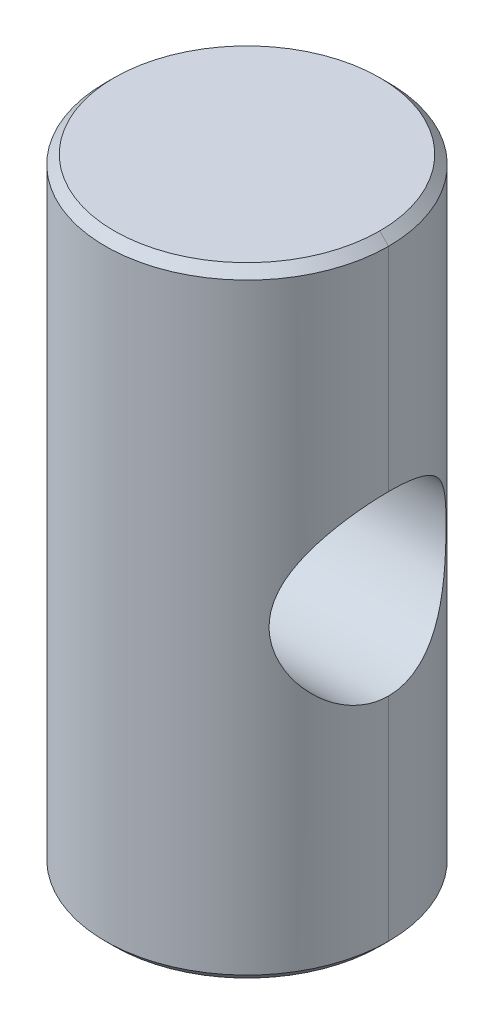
ISO-10303-21;
HEADER;
FILE_DESCRIPTION(('STEP AP214'),'2;1');
FILE_NAME('part.step','',(''),(''),'','','');
FILE_SCHEMA(('AUTOMOTIVE_DESIGN { 1 0 10303 214 1 1 1 1 }'));
ENDSEC;
DATA;
#1=APPLICATION_CONTEXT('core data for automotive mechanical design processes');
#2=APPLICATION_PROTOCOL_DEFINITION('international standard','automotive_design',2000,#1);
#3=PRODUCT_CONTEXT('',#1,'mechanical');
#4=PRODUCT('Part','Part','',(#3));
#5=PRODUCT_RELATED_PRODUCT_CATEGORY('part','',(#4));
#6=PRODUCT_DEFINITION_FORMATION('','',#4);
#7=PRODUCT_DEFINITION_CONTEXT('part definition',#1,'design');
#8=PRODUCT_DEFINITION('design','',#6,#7);
#9=PRODUCT_DEFINITION_SHAPE('','',#8);
#10=(LENGTH_UNIT() NAMED_UNIT(*) SI_UNIT(.MILLI.,.METRE.));
#11=(NAMED_UNIT(*) PLANE_ANGLE_UNIT() SI_UNIT($,.RADIAN.));
#12=(NAMED_UNIT(*) SI_UNIT($,.STERADIAN.) SOLID_ANGLE_UNIT());
#13=UNCERTAINTY_MEASURE_WITH_UNIT(LENGTH_MEASURE(1.E-05),#10,'distance_accuracy_value','');
#14=(GEOMETRIC_REPRESENTATION_CONTEXT(3) GLOBAL_UNCERTAINTY_ASSIGNED_CONTEXT((#13)) GLOBAL_UNIT_ASSIGNED_CONTEXT((#10,
#11,#12)) REPRESENTATION_CONTEXT('',''));
#15=CARTESIAN_POINT('',(0.,0.,0.));
#16=DIRECTION('',(0.,0.,1.));
#17=DIRECTION('',(1.,0.,0.));
#18=AXIS2_PLACEMENT_3D('',#15,#16,#17);
#19=CARTESIAN_POINT('',(0.,-17.5,0.));
#20=DIRECTION('',(0.,1.,0.));
#21=DIRECTION('',(-1.,0.,0.));
#22=AXIS2_PLACEMENT_3D('',#19,#20,#21);
#23=CONICAL_SURFACE('',#22,7.5,0.785398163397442);
#24=CARTESIAN_POINT('',(0.,-17.5,0.));
#25=DIRECTION('',(0.,-1.,0.));
#26=DIRECTION('',(1.,0.,0.));
#27=AXIS2_PLACEMENT_3D('',#24,#25,#26);
#28=CIRCLE('',#27,7.5);
#29=CARTESIAN_POINT('',(7.5,-17.5,0.));
#30=VERTEX_POINT('',#29);
#31=CARTESIAN_POINT('',(-7.5,-17.5,0.));
#32=VERTEX_POINT('',#31);
#33=EDGE_CURVE('E136',#30,#32,#28,.T.);
#34=ORIENTED_EDGE('',*,*,#33,.F.);
#35=DIRECTION('',(0.707106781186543,0.707106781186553,0.));
#36=VECTOR('',#35,1.);
#37=CARTESIAN_POINT('',(7.5,-17.5,0.));
#38=LINE('',#37,#36);
#39=CARTESIAN_POINT('',(8.,-17.,0.));
#40=VERTEX_POINT('',#39);
#41=EDGE_CURVE('E81',#30,#40,#38,.T.);
#42=ORIENTED_EDGE('',*,*,#41,.T.);
#43=CARTESIAN_POINT('',(0.,-17.,0.));
#44=DIRECTION('',(0.,1.,0.));
#45=DIRECTION('',(1.,0.,0.));
#46=AXIS2_PLACEMENT_3D('',#43,#44,#45);
#47=CIRCLE('',#46,8.);
#48=CARTESIAN_POINT('',(-8.,-17.,0.));
#49=VERTEX_POINT('',#48);
#50=EDGE_CURVE('E96',#49,#40,#47,.T.);
#51=ORIENTED_EDGE('',*,*,#50,.F.);
#52=DIRECTION('',(-0.707106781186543,0.707106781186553,0.));
#53=VECTOR('',#52,1.);
#54=CARTESIAN_POINT('',(-7.5,-17.5,0.));
#55=LINE('',#54,#53);
#56=EDGE_CURVE('E144',#32,#49,#55,.T.);
#57=ORIENTED_EDGE('',*,*,#56,.F.);
#58=EDGE_LOOP('',(#34,#42,#51,#57));
#59=FACE_BOUND('',#58,.T.);
#60=ADVANCED_FACE('F14',(#59),#23,.T.);
#61=CARTESIAN_POINT('',(0.,17.,0.));
#62=DIRECTION('',(0.,-1.,0.));
#63=DIRECTION('',(1.,0.,0.));
#64=AXIS2_PLACEMENT_3D('',#61,#62,#63);
#65=CONICAL_SURFACE('',#64,8.,0.785398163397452);
#66=CARTESIAN_POINT('',(0.,17.5,0.));
#67=DIRECTION('',(0.,1.,0.));
#68=DIRECTION('',(1.,0.,0.));
#69=AXIS2_PLACEMENT_3D('',#66,#67,#68);
#70=CIRCLE('',#69,7.5);
#71=CARTESIAN_POINT('',(-7.5,17.5,0.));
#72=VERTEX_POINT('',#71);
#73=CARTESIAN_POINT('',(7.5,17.5,0.));
#74=VERTEX_POINT('',#73);
#75=EDGE_CURVE('E140',#72,#74,#70,.T.);
#76=ORIENTED_EDGE('',*,*,#75,.F.);
#77=DIRECTION('',(-0.70710678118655,-0.707106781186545,0.));
#78=VECTOR('',#77,1.);
#79=CARTESIAN_POINT('',(-8.,17.,0.));
#80=LINE('',#79,#78);
#81=CARTESIAN_POINT('',(-8.,17.,0.));
#82=VERTEX_POINT('',#81);
#83=EDGE_CURVE('E164',#72,#82,#80,.T.);
#84=ORIENTED_EDGE('',*,*,#83,.T.);
#85=CARTESIAN_POINT('',(0.,17.,0.));
#86=DIRECTION('',(0.,-1.,0.));
#87=DIRECTION('',(1.,0.,0.));
#88=AXIS2_PLACEMENT_3D('',#85,#86,#87);
#89=CIRCLE('',#88,8.);
#90=CARTESIAN_POINT('',(8.,17.,0.));
#91=VERTEX_POINT('',#90);
#92=EDGE_CURVE('E93',#91,#82,#89,.T.);
#93=ORIENTED_EDGE('',*,*,#92,.F.);
#94=DIRECTION('',(0.70710678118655,-0.707106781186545,0.));
#95=VECTOR('',#94,1.);
#96=CARTESIAN_POINT('',(8.,17.,0.));
#97=LINE('',#96,#95);
#98=EDGE_CURVE('E142',#74,#91,#97,.T.);
#99=ORIENTED_EDGE('',*,*,#98,.F.);
#100=EDGE_LOOP('',(#76,#84,#93,#99));
#101=FACE_BOUND('',#100,.T.);
#102=ADVANCED_FACE('F193',(#101),#65,.T.);
#103=CARTESIAN_POINT('',(0.,-17.5,0.));
#104=DIRECTION('',(0.,1.,0.));
#105=DIRECTION('',(-1.,0.,0.));
#106=AXIS2_PLACEMENT_3D('',#103,#104,#105);
#107=CYLINDRICAL_SURFACE('',#106,8.);
#108=CARTESIAN_POINT('',(8.,5.,0.));
#109=CARTESIAN_POINT('',(8.00002711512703,5.00002494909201,0.127651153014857));
#110=CARTESIAN_POINT('',(7.99694579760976,4.99511271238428,0.255287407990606));
#111=CARTESIAN_POINT('',(7.98476741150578,4.9756022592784,0.509462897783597));
#112=CARTESIAN_POINT('',(7.97567352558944,4.96100916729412,0.636002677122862));
#113=CARTESIAN_POINT('',(7.9517396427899,4.92243610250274,0.886334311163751));
#114=CARTESIAN_POINT('',(7.93693294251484,4.8985105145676,1.01013777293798));
#115=CARTESIAN_POINT('',(7.90193514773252,4.84159946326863,1.25486942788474));
#116=CARTESIAN_POINT('',(7.88174357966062,4.80861320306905,1.37579736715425));
#117=CARTESIAN_POINT('',(7.83648041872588,4.73405757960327,1.61375684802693));
#118=CARTESIAN_POINT('',(7.81141884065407,4.69250582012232,1.73079581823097));
#119=CARTESIAN_POINT('',(7.75693104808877,4.60122961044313,1.96061065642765));
#120=CARTESIAN_POINT('',(7.72750313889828,4.551501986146,2.07338484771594));
#121=CARTESIAN_POINT('',(7.63350141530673,4.3906681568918,2.40462805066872));
#122=CARTESIAN_POINT('',(7.56322017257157,4.26792796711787,2.61596427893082));
#123=CARTESIAN_POINT('',(7.40679663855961,3.98443458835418,3.03194702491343));
#124=CARTESIAN_POINT('',(7.31983890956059,3.82144031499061,3.23473730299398));
#125=CARTESIAN_POINT('',(7.14122605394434,3.46707119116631,3.61198454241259));
#126=CARTESIAN_POINT('',(7.04956541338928,3.27566250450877,3.78640719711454));
#127=CARTESIAN_POINT('',(6.90836179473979,2.95571339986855,4.03551126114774));
#128=CARTESIAN_POINT('',(6.85772129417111,2.83571110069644,4.12074148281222));
#129=CARTESIAN_POINT('',(6.75899502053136,2.58784522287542,4.28074867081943));
#130=CARTESIAN_POINT('',(6.71090972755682,2.45998017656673,4.35552367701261));
#131=CARTESIAN_POINT('',(6.61907512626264,2.1971107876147,4.49385504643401));
#132=CARTESIAN_POINT('',(6.57531907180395,2.06211807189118,4.55742898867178));
#133=CARTESIAN_POINT('',(6.49385099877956,1.78537544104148,4.6727819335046));
#134=CARTESIAN_POINT('',(6.45613899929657,1.64362550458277,4.72456089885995));
#135=CARTESIAN_POINT('',(6.39737755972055,1.39186712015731,4.80367756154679));
#136=CARTESIAN_POINT('',(6.37454359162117,1.28316537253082,4.83387106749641));
#137=CARTESIAN_POINT('',(6.33391363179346,1.06308376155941,4.88698871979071));
#138=CARTESIAN_POINT('',(6.31611649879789,0.951704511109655,4.90991451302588));
#139=CARTESIAN_POINT('',(6.28619046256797,0.727027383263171,4.94817146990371));
#140=CARTESIAN_POINT('',(6.27405491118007,0.613731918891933,4.96351154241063));
#141=CARTESIAN_POINT('',(6.25587663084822,0.385860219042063,4.98640381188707));
#142=CARTESIAN_POINT('',(6.24983413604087,0.271283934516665,4.99395570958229));
#143=CARTESIAN_POINT('',(6.24407625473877,0.0414410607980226,5.00115325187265));
#144=CARTESIAN_POINT('',(6.24437637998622,-0.0738265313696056,5.00077951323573));
#145=CARTESIAN_POINT('',(6.25133019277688,-0.303907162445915,4.99208380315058));
#146=CARTESIAN_POINT('',(6.25798621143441,-0.418720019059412,4.98375891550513));
#147=CARTESIAN_POINT('',(6.27739600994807,-0.647022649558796,4.95928853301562));
#148=CARTESIAN_POINT('',(6.2901516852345,-0.760512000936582,4.94314060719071));
#149=CARTESIAN_POINT('',(6.32127817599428,-0.985386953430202,4.90327177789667));
#150=CARTESIAN_POINT('',(6.33965130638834,-1.0967716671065,4.87954775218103));
#151=CARTESIAN_POINT('',(6.40129912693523,-1.42161885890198,4.79874214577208));
#152=CARTESIAN_POINT('',(6.45162656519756,-1.63129028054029,4.73140757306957));
#153=CARTESIAN_POINT('',(6.56582349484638,-2.0366800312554,4.57160236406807));
#154=CARTESIAN_POINT('',(6.62969791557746,-2.23239324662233,4.47912257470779));
#155=CARTESIAN_POINT('',(6.77819265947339,-2.64332276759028,4.25179961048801));
#156=CARTESIAN_POINT('',(6.86445933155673,-2.85535064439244,4.11226962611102));
#157=CARTESIAN_POINT('',(7.04024561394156,-3.25536286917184,3.80348557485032));
#158=CARTESIAN_POINT('',(7.12976826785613,-3.44332393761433,3.63420309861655));
#159=CARTESIAN_POINT('',(7.26823966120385,-3.71954351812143,3.34465416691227));
#160=CARTESIAN_POINT('',(7.31854152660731,-3.81669498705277,3.23338220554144));
#161=CARTESIAN_POINT('',(7.41646818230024,-4.00126581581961,3.00195971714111));
#162=CARTESIAN_POINT('',(7.46409386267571,-4.08868842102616,2.88181217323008));
#163=CARTESIAN_POINT('',(7.55542190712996,-4.25312516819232,2.63309000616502));
#164=CARTESIAN_POINT('',(7.59912238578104,-4.33013431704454,2.50451138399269));
#165=CARTESIAN_POINT('',(7.68134887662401,-4.47286528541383,2.23966378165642));
#166=CARTESIAN_POINT('',(7.71987574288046,-4.53858896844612,2.10339607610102));
#167=CARTESIAN_POINT('',(7.7887337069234,-4.6547223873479,1.83145983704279));
#168=CARTESIAN_POINT('',(7.81939089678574,-4.70575901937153,1.69614211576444));
#169=CARTESIAN_POINT('',(7.87414862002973,-4.79619775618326,1.42039722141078));
#170=CARTESIAN_POINT('',(7.89825054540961,-4.83560233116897,1.27997114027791));
#171=CARTESIAN_POINT('',(7.93910014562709,-4.90203993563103,0.995621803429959));
#172=CARTESIAN_POINT('',(7.95586939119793,-4.92910926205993,0.851710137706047));
#173=CARTESIAN_POINT('',(7.98160016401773,-4.97053395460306,0.561465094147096));
#174=CARTESIAN_POINT('',(7.99056885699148,-4.98490098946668,0.415134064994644));
#175=CARTESIAN_POINT('',(7.99699757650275,-4.99519478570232,0.223694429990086));
#176=CARTESIAN_POINT('',(7.99812365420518,-4.9969973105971,0.178957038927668));
#177=CARTESIAN_POINT('',(7.99962432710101,-4.99939906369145,0.0894820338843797));
#178=CARTESIAN_POINT('',(7.99999967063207,-4.99999949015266,0.0447444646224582));
#179=CARTESIAN_POINT('',(8.,-5.,0.));
#180=B_SPLINE_CURVE_WITH_KNOTS('',3,(#108,#109,#110,#111,#112,#113,#114,#115,#116,#117,#118,
#119,#120,#121,#122,#123,#124,#125,#126,#127,#128,#129,#130,#131,#132,#133,#134,#135,#136,#137,
#138,#139,#140,#141,#142,#143,#144,#145,#146,#147,#148,#149,#150,#151,#152,#153,#154,#155,#156,
#157,#158,#159,#160,#161,#162,#163,#164,#165,#166,#167,#168,#169,#170,#171,#172,#173,#174,#175,
#176,#177,#178,#179),.UNSPECIFIED.,.F.,.F.,(4,2,2,2,2,2,2,2,2,2,2,2,2,2,2,2,2,2,2,2,2,2,2,2,2,2,
2,2,2,2,2,2,2,2,2,4),(0.,0.382798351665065,0.765394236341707,1.14579308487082,1.52622539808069,
1.90588350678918,2.28568935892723,3.04547025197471,3.865440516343,4.68639516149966,
5.15289164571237,5.61947547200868,6.08532038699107,6.55116677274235,6.89614673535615,
7.24104846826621,7.58554417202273,7.93005311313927,8.2754046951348,8.62088298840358,
8.96646870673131,9.31219703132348,9.98712369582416,10.6622963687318,11.46362078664,
12.2657145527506,12.7333542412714,13.200837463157,13.6685440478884,14.1361733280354,
14.5790252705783,15.0217831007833,15.4632295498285,15.9042700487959,16.0386180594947,
16.1728320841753),.UNSPECIFIED.);
#181=CARTESIAN_POINT('',(8.,5.,0.));
#182=VERTEX_POINT('',#181);
#183=CARTESIAN_POINT('',(8.,-5.,0.));
#184=VERTEX_POINT('',#183);
#185=EDGE_CURVE('E40',#182,#184,#180,.T.);
#186=ORIENTED_EDGE('',*,*,#185,.F.);
#187=DIRECTION('',(0.,1.,0.));
#188=VECTOR('',#187,1.);
#189=CARTESIAN_POINT('',(8.,-17.5,0.));
#190=LINE('',#189,#188);
#191=EDGE_CURVE('E84',#182,#91,#190,.T.);
#192=ORIENTED_EDGE('',*,*,#191,.T.);
#193=ORIENTED_EDGE('',*,*,#92,.T.);
#194=DIRECTION('',(0.,1.,0.));
#195=VECTOR('',#194,1.);
#196=CARTESIAN_POINT('',(-8.,-17.5,0.));
#197=LINE('',#196,#195);
#198=CARTESIAN_POINT('',(-8.,5.,0.));
#199=VERTEX_POINT('',#198);
#200=EDGE_CURVE('E103',#199,#82,#197,.T.);
#201=ORIENTED_EDGE('',*,*,#200,.F.);
#202=CARTESIAN_POINT('',(-8.,-5.,0.));
#203=CARTESIAN_POINT('',(-8.00002711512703,-5.00002494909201,0.127651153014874));
#204=CARTESIAN_POINT('',(-7.99694579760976,-4.99511271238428,0.255287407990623));
#205=CARTESIAN_POINT('',(-7.98476741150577,-4.9756022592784,0.509462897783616));
#206=CARTESIAN_POINT('',(-7.97567352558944,-4.96100916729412,0.636002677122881));
#207=CARTESIAN_POINT('',(-7.9517396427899,-4.92243610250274,0.886334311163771));
#208=CARTESIAN_POINT('',(-7.93693294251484,-4.89851051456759,1.010137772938));
#209=CARTESIAN_POINT('',(-7.90193514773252,-4.84159946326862,1.25486942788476));
#210=CARTESIAN_POINT('',(-7.88174357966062,-4.80861320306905,1.37579736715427));
#211=CARTESIAN_POINT('',(-7.83648041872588,-4.73405757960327,1.61375684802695));
#212=CARTESIAN_POINT('',(-7.81141884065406,-4.69250582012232,1.73079581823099));
#213=CARTESIAN_POINT('',(-7.75693104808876,-4.60122961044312,1.96061065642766));
#214=CARTESIAN_POINT('',(-7.72750313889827,-4.551501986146,2.07338484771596));
#215=CARTESIAN_POINT('',(-7.63350141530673,-4.39066815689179,2.40462805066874));
#216=CARTESIAN_POINT('',(-7.56322017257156,-4.26792796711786,2.61596427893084));
#217=CARTESIAN_POINT('',(-7.4067966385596,-3.98443458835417,3.03194702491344));
#218=CARTESIAN_POINT('',(-7.31983890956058,-3.8214403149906,3.234737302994));
#219=CARTESIAN_POINT('',(-7.14122605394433,-3.4670711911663,3.61198454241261));
#220=CARTESIAN_POINT('',(-7.04956541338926,-3.27566250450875,3.78640719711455));
#221=CARTESIAN_POINT('',(-6.90836179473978,-2.95571339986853,4.03551126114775));
#222=CARTESIAN_POINT('',(-6.8577212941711,-2.83571110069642,4.12074148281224));
#223=CARTESIAN_POINT('',(-6.75899502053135,-2.5878452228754,4.28074867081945));
#224=CARTESIAN_POINT('',(-6.71090972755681,-2.45998017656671,4.35552367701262));
#225=CARTESIAN_POINT('',(-6.61907512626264,-2.19711078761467,4.49385504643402));
#226=CARTESIAN_POINT('',(-6.57531907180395,-2.06211807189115,4.55742898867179));
#227=CARTESIAN_POINT('',(-6.49385099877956,-1.78537544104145,4.67278193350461));
#228=CARTESIAN_POINT('',(-6.45613899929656,-1.64362550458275,4.72456089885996));
#229=CARTESIAN_POINT('',(-6.39737755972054,-1.39186712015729,4.8036775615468));
#230=CARTESIAN_POINT('',(-6.37454359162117,-1.28316537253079,4.83387106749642));
#231=CARTESIAN_POINT('',(-6.33391363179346,-1.06308376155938,4.88698871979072));
#232=CARTESIAN_POINT('',(-6.31611649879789,-0.951704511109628,4.90991451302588));
#233=CARTESIAN_POINT('',(-6.28619046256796,-0.727027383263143,4.94817146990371));
#234=CARTESIAN_POINT('',(-6.27405491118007,-0.613731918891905,4.96351154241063));
#235=CARTESIAN_POINT('',(-6.25587663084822,-0.385860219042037,4.98640381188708));
#236=CARTESIAN_POINT('',(-6.24983413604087,-0.271283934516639,4.9939557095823));
#237=CARTESIAN_POINT('',(-6.24407625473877,-0.0414410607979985,5.00115325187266));
#238=CARTESIAN_POINT('',(-6.24437637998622,0.0738265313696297,5.00077951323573));
#239=CARTESIAN_POINT('',(-6.25133019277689,0.303907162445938,4.99208380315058));
#240=CARTESIAN_POINT('',(-6.25798621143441,0.418720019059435,4.98375891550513));
#241=CARTESIAN_POINT('',(-6.27739600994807,0.647022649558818,4.95928853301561));
#242=CARTESIAN_POINT('',(-6.2901516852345,0.760512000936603,4.9431406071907));
#243=CARTESIAN_POINT('',(-6.32127817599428,0.985386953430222,4.90327177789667));
#244=CARTESIAN_POINT('',(-6.33965130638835,1.09677166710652,4.87954775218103));
#245=CARTESIAN_POINT('',(-6.40129912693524,1.421618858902,4.79874214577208));
#246=CARTESIAN_POINT('',(-6.45162656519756,1.63129028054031,4.73140757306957));
#247=CARTESIAN_POINT('',(-6.56582349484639,2.03668003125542,4.57160236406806));
#248=CARTESIAN_POINT('',(-6.62969791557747,2.23239324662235,4.47912257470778));
#249=CARTESIAN_POINT('',(-6.7781926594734,2.6433227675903,4.251799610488));
#250=CARTESIAN_POINT('',(-6.86445933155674,2.85535064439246,4.112269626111));
#251=CARTESIAN_POINT('',(-7.04024561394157,3.25536286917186,3.8034855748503));
#252=CARTESIAN_POINT('',(-7.12976826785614,3.44332393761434,3.63420309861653));
#253=CARTESIAN_POINT('',(-7.26823966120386,3.71954351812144,3.34465416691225));
#254=CARTESIAN_POINT('',(-7.31854152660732,3.81669498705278,3.23338220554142));
#255=CARTESIAN_POINT('',(-7.41646818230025,4.00126581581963,3.00195971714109));
#256=CARTESIAN_POINT('',(-7.46409386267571,4.08868842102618,2.88181217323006));
#257=CARTESIAN_POINT('',(-7.55542190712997,4.25312516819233,2.633090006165));
#258=CARTESIAN_POINT('',(-7.59912238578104,4.33013431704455,2.50451138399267));
#259=CARTESIAN_POINT('',(-7.68134887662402,4.47286528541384,2.2396637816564));
#260=CARTESIAN_POINT('',(-7.71987574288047,4.53858896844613,2.103396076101));
#261=CARTESIAN_POINT('',(-7.78873370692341,4.65472238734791,1.83145983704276));
#262=CARTESIAN_POINT('',(-7.81939089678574,4.70575901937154,1.69614211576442));
#263=CARTESIAN_POINT('',(-7.87414862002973,4.79619775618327,1.42039722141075));
#264=CARTESIAN_POINT('',(-7.89825054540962,4.83560233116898,1.27997114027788));
#265=CARTESIAN_POINT('',(-7.93910014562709,4.90203993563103,0.995621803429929));
#266=CARTESIAN_POINT('',(-7.95586939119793,4.92910926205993,0.851710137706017));
#267=CARTESIAN_POINT('',(-7.98160016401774,4.97053395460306,0.561465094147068));
#268=CARTESIAN_POINT('',(-7.9905688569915,4.9849009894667,0.415134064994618));
#269=CARTESIAN_POINT('',(-7.99699757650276,4.99519478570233,0.223694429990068));
#270=CARTESIAN_POINT('',(-7.99812365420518,4.99699731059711,0.178957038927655));
#271=CARTESIAN_POINT('',(-7.99962432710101,4.99939906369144,0.0894820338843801));
#272=CARTESIAN_POINT('',(-7.99999967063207,4.99999949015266,0.0447444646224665));
#273=CARTESIAN_POINT('',(-8.,5.,0.));
#274=B_SPLINE_CURVE_WITH_KNOTS('',3,(#202,#203,#204,#205,#206,#207,#208,#209,#210,#211,#212,
#213,#214,#215,#216,#217,#218,#219,#220,#221,#222,#223,#224,#225,#226,#227,#228,#229,#230,#231,
#232,#233,#234,#235,#236,#237,#238,#239,#240,#241,#242,#243,#244,#245,#246,#247,#248,#249,#250,
#251,#252,#253,#254,#255,#256,#257,#258,#259,#260,#261,#262,#263,#264,#265,#266,#267,#268,#269,
#270,#271,#272,#273),.UNSPECIFIED.,.F.,.F.,(4,2,2,2,2,2,2,2,2,2,2,2,2,2,2,2,2,2,2,2,2,2,2,2,2,2,
2,2,2,2,2,2,2,2,2,4),(0.,0.382798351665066,0.76539423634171,1.14579308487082,1.52622539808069,
1.90588350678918,2.28568935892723,3.04547025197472,3.86544051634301,4.68639516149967,
5.15289164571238,5.61947547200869,6.08532038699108,6.55116677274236,6.89614673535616,
7.24104846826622,7.58554417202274,7.93005311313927,8.2754046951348,8.62088298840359,
8.96646870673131,9.31219703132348,9.98712369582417,10.6622963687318,11.46362078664,
12.2657145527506,12.7333542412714,13.200837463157,13.6685440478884,14.1361733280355,
14.5790252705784,15.0217831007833,15.4632295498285,15.9042700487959,16.0386180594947,
16.1728320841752),.UNSPECIFIED.);
#275=CARTESIAN_POINT('',(-8.,-5.,0.));
#276=VERTEX_POINT('',#275);
#277=EDGE_CURVE('E33',#276,#199,#274,.T.);
#278=ORIENTED_EDGE('',*,*,#277,.F.);
#279=DIRECTION('',(0.,1.,0.));
#280=VECTOR('',#279,1.);
#281=CARTESIAN_POINT('',(-8.,-17.5,0.));
#282=LINE('',#281,#280);
#283=EDGE_CURVE('E115',#49,#276,#282,.T.);
#284=ORIENTED_EDGE('',*,*,#283,.F.);
#285=ORIENTED_EDGE('',*,*,#50,.T.);
#286=DIRECTION('',(0.,1.,0.));
#287=VECTOR('',#286,1.);
#288=CARTESIAN_POINT('',(8.,-17.5,0.));
#289=LINE('',#288,#287);
#290=EDGE_CURVE('E87',#40,#184,#289,.T.);
#291=ORIENTED_EDGE('',*,*,#290,.T.);
#292=EDGE_LOOP('',(#186,#192,#193,#201,#278,#284,#285,#291));
#293=FACE_BOUND('',#292,.T.);
#294=ADVANCED_FACE('F16',(#293),#107,.T.);
#295=CARTESIAN_POINT('',(0.,-17.5,0.));
#296=DIRECTION('',(0.,1.,0.));
#297=DIRECTION('',(-1.,0.,0.));
#298=AXIS2_PLACEMENT_3D('',#295,#296,#297);
#299=CYLINDRICAL_SURFACE('',#298,8.);
#300=CARTESIAN_POINT('',(-8.,5.,0.));
#301=CARTESIAN_POINT('',(-8.00002711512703,5.00002494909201,-0.127651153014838));
#302=CARTESIAN_POINT('',(-7.99694579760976,4.99511271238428,-0.255287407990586));
#303=CARTESIAN_POINT('',(-7.98476741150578,4.9756022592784,-0.509462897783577));
#304=CARTESIAN_POINT('',(-7.97567352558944,4.96100916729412,-0.636002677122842));
#305=CARTESIAN_POINT('',(-7.95173964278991,4.92243610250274,-0.886334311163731));
#306=CARTESIAN_POINT('',(-7.93693294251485,4.8985105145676,-1.01013777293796));
#307=CARTESIAN_POINT('',(-7.90193514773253,4.84159946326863,-1.25486942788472));
#308=CARTESIAN_POINT('',(-7.88174357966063,4.80861320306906,-1.37579736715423));
#309=CARTESIAN_POINT('',(-7.83648041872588,4.73405757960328,-1.61375684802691));
#310=CARTESIAN_POINT('',(-7.81141884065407,4.69250582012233,-1.73079581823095));
#311=CARTESIAN_POINT('',(-7.75693104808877,4.60122961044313,-1.96061065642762));
#312=CARTESIAN_POINT('',(-7.72750313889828,4.55150198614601,-2.07338484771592));
#313=CARTESIAN_POINT('',(-7.63350141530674,4.39066815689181,-2.4046280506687));
#314=CARTESIAN_POINT('',(-7.56322017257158,4.26792796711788,-2.6159642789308));
#315=CARTESIAN_POINT('',(-7.40679663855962,3.98443458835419,-3.03194702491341));
#316=CARTESIAN_POINT('',(-7.3198389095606,3.82144031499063,-3.23473730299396));
#317=CARTESIAN_POINT('',(-7.14122605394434,3.46707119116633,-3.61198454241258));
#318=CARTESIAN_POINT('',(-7.04956541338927,3.27566250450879,-3.78640719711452));
#319=CARTESIAN_POINT('',(-6.90836179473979,2.95571339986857,-4.03551126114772));
#320=CARTESIAN_POINT('',(-6.85772129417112,2.83571110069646,-4.12074148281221));
#321=CARTESIAN_POINT('',(-6.75899502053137,2.58784522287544,-4.28074867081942));
#322=CARTESIAN_POINT('',(-6.71090972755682,2.45998017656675,-4.3555236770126));
#323=CARTESIAN_POINT('',(-6.61907512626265,2.19711078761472,-4.493855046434));
#324=CARTESIAN_POINT('',(-6.57531907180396,2.0621180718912,-4.55742898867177));
#325=CARTESIAN_POINT('',(-6.49385099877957,1.7853754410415,-4.67278193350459));
#326=CARTESIAN_POINT('',(-6.45613899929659,1.6436255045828,-4.72456089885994));
#327=CARTESIAN_POINT('',(-6.39737755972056,1.39186712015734,-4.80367756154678));
#328=CARTESIAN_POINT('',(-6.37454359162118,1.28316537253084,-4.83387106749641));
#329=CARTESIAN_POINT('',(-6.33391363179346,1.06308376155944,-4.88698871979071));
#330=CARTESIAN_POINT('',(-6.3161164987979,0.95170451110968,-4.90991451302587));
#331=CARTESIAN_POINT('',(-6.28619046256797,0.727027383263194,-4.9481714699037));
#332=CARTESIAN_POINT('',(-6.27405491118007,0.613731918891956,-4.96351154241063));
#333=CARTESIAN_POINT('',(-6.25587663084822,0.385860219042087,-4.98640381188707));
#334=CARTESIAN_POINT('',(-6.24983413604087,0.271283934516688,-4.99395570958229));
#335=CARTESIAN_POINT('',(-6.24407625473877,0.0414410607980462,-5.00115325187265));
#336=CARTESIAN_POINT('',(-6.24437637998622,-0.0738265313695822,-5.00077951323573));
#337=CARTESIAN_POINT('',(-6.25133019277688,-0.303907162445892,-4.99208380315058));
#338=CARTESIAN_POINT('',(-6.25798621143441,-0.418720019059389,-4.98375891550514));
#339=CARTESIAN_POINT('',(-6.27739600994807,-0.647022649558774,-4.95928853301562));
#340=CARTESIAN_POINT('',(-6.2901516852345,-0.76051200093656,-4.94314060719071));
#341=CARTESIAN_POINT('',(-6.32127817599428,-0.985386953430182,-4.90327177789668));
#342=CARTESIAN_POINT('',(-6.33965130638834,-1.09677166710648,-4.87954775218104));
#343=CARTESIAN_POINT('',(-6.40129912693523,-1.42161885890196,-4.79874214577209));
#344=CARTESIAN_POINT('',(-6.45162656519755,-1.63129028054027,-4.73140757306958));
#345=CARTESIAN_POINT('',(-6.56582349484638,-2.03668003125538,-4.57160236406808));
#346=CARTESIAN_POINT('',(-6.62969791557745,-2.23239324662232,-4.4791225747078));
#347=CARTESIAN_POINT('',(-6.77819265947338,-2.64332276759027,-4.25179961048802));
#348=CARTESIAN_POINT('',(-6.86445933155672,-2.85535064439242,-4.11226962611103));
#349=CARTESIAN_POINT('',(-7.04024561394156,-3.25536286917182,-3.80348557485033));
#350=CARTESIAN_POINT('',(-7.12976826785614,-3.44332393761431,-3.63420309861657));
#351=CARTESIAN_POINT('',(-7.26823966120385,-3.71954351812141,-3.34465416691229));
#352=CARTESIAN_POINT('',(-7.31854152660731,-3.81669498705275,-3.23338220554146));
#353=CARTESIAN_POINT('',(-7.41646818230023,-4.0012658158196,-3.00195971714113));
#354=CARTESIAN_POINT('',(-7.4640938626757,-4.08868842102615,-2.8818121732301));
#355=CARTESIAN_POINT('',(-7.55542190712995,-4.2531251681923,-2.63309000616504));
#356=CARTESIAN_POINT('',(-7.59912238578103,-4.33013431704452,-2.50451138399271));
#357=CARTESIAN_POINT('',(-7.68134887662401,-4.47286528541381,-2.23966378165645));
#358=CARTESIAN_POINT('',(-7.71987574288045,-4.5385889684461,-2.10339607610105));
#359=CARTESIAN_POINT('',(-7.7887337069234,-4.65472238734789,-1.83145983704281));
#360=CARTESIAN_POINT('',(-7.81939089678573,-4.70575901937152,-1.69614211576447));
#361=CARTESIAN_POINT('',(-7.87414862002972,-4.79619775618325,-1.4203972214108));
#362=CARTESIAN_POINT('',(-7.89825054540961,-4.83560233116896,-1.27997114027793));
#363=CARTESIAN_POINT('',(-7.93910014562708,-4.90203993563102,-0.995621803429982));
#364=CARTESIAN_POINT('',(-7.95586939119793,-4.92910926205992,-0.85171013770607));
#365=CARTESIAN_POINT('',(-7.98160016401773,-4.97053395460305,-0.561465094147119));
#366=CARTESIAN_POINT('',(-7.99056885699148,-4.98490098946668,-0.415134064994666));
#367=CARTESIAN_POINT('',(-7.99699757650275,-4.99519478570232,-0.223694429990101));
#368=CARTESIAN_POINT('',(-7.99812365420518,-4.9969973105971,-0.178957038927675));
#369=CARTESIAN_POINT('',(-7.99962432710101,-4.99939906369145,-0.0894820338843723));
#370=CARTESIAN_POINT('',(-7.99999967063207,-4.99999949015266,-0.044744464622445));
#371=CARTESIAN_POINT('',(-8.,-5.,0.));
#372=B_SPLINE_CURVE_WITH_KNOTS('',3,(#300,#301,#302,#303,#304,#305,#306,#307,#308,#309,#310,
#311,#312,#313,#314,#315,#316,#317,#318,#319,#320,#321,#322,#323,#324,#325,#326,#327,#328,#329,
#330,#331,#332,#333,#334,#335,#336,#337,#338,#339,#340,#341,#342,#343,#344,#345,#346,#347,#348,
#349,#350,#351,#352,#353,#354,#355,#356,#357,#358,#359,#360,#361,#362,#363,#364,#365,#366,#367,
#368,#369,#370,#371),.UNSPECIFIED.,.F.,.F.,(4,2,2,2,2,2,2,2,2,2,2,2,2,2,2,2,2,2,2,2,2,2,2,2,2,2,
2,2,2,2,2,2,2,2,2,4),(0.,0.382798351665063,0.765394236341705,1.14579308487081,1.52622539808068,
1.90588350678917,2.28568935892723,3.04547025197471,3.865440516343,4.68639516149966,
5.15289164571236,5.61947547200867,6.08532038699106,6.55116677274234,6.89614673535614,
7.24104846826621,7.58554417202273,7.93005311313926,8.27540469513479,8.62088298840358,
8.9664687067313,9.31219703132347,9.98712369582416,10.6622963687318,11.46362078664,
12.2657145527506,12.7333542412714,13.200837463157,13.6685440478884,14.1361733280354,
14.5790252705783,15.0217831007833,15.4632295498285,15.9042700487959,16.0386180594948,
16.1728320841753),.UNSPECIFIED.);
#373=EDGE_CURVE('E9',#199,#276,#372,.T.);
#374=ORIENTED_EDGE('',*,*,#373,.F.);
#375=ORIENTED_EDGE('',*,*,#200,.T.);
#376=CARTESIAN_POINT('',(0.,17.,0.));
#377=DIRECTION('',(0.,-1.,0.));
#378=DIRECTION('',(1.,0.,0.));
#379=AXIS2_PLACEMENT_3D('',#376,#377,#378);
#380=CIRCLE('',#379,8.);
#381=EDGE_CURVE('E92',#82,#91,#380,.T.);
#382=ORIENTED_EDGE('',*,*,#381,.T.);
#383=ORIENTED_EDGE('',*,*,#191,.F.);
#384=CARTESIAN_POINT('',(8.,-5.,0.));
#385=CARTESIAN_POINT('',(8.00002711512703,-5.00002494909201,-0.127651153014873));
#386=CARTESIAN_POINT('',(7.99694579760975,-4.99511271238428,-0.255287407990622));
#387=CARTESIAN_POINT('',(7.98476741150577,-4.9756022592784,-0.509462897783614));
#388=CARTESIAN_POINT('',(7.97567352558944,-4.96100916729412,-0.63600267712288));
#389=CARTESIAN_POINT('',(7.9517396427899,-4.92243610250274,-0.886334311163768));
#390=CARTESIAN_POINT('',(7.93693294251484,-4.89851051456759,-1.01013777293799));
#391=CARTESIAN_POINT('',(7.90193514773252,-4.84159946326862,-1.25486942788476));
#392=CARTESIAN_POINT('',(7.88174357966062,-4.80861320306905,-1.37579736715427));
#393=CARTESIAN_POINT('',(7.83648041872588,-4.73405757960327,-1.61375684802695));
#394=CARTESIAN_POINT('',(7.81141884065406,-4.69250582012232,-1.73079581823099));
#395=CARTESIAN_POINT('',(7.75693104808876,-4.60122961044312,-1.96061065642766));
#396=CARTESIAN_POINT('',(7.72750313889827,-4.551501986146,-2.07338484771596));
#397=CARTESIAN_POINT('',(7.63350141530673,-4.39066815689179,-2.40462805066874));
#398=CARTESIAN_POINT('',(7.56322017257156,-4.26792796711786,-2.61596427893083));
#399=CARTESIAN_POINT('',(7.4067966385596,-3.98443458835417,-3.03194702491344));
#400=CARTESIAN_POINT('',(7.31983890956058,-3.8214403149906,-3.234737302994));
#401=CARTESIAN_POINT('',(7.14122605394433,-3.4670711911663,-3.61198454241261));
#402=CARTESIAN_POINT('',(7.04956541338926,-3.27566250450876,-3.78640719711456));
#403=CARTESIAN_POINT('',(6.90836179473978,-2.95571339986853,-4.03551126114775));
#404=CARTESIAN_POINT('',(6.85772129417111,-2.83571110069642,-4.12074148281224));
#405=CARTESIAN_POINT('',(6.75899502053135,-2.5878452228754,-4.28074867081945));
#406=CARTESIAN_POINT('',(6.71090972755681,-2.45998017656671,-4.35552367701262));
#407=CARTESIAN_POINT('',(6.61907512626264,-2.19711078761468,-4.49385504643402));
#408=CARTESIAN_POINT('',(6.57531907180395,-2.06211807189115,-4.55742898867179));
#409=CARTESIAN_POINT('',(6.49385099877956,-1.78537544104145,-4.67278193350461));
#410=CARTESIAN_POINT('',(6.45613899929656,-1.64362550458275,-4.72456089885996));
#411=CARTESIAN_POINT('',(6.39737755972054,-1.39186712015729,-4.8036775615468));
#412=CARTESIAN_POINT('',(6.37454359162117,-1.28316537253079,-4.83387106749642));
#413=CARTESIAN_POINT('',(6.33391363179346,-1.06308376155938,-4.88698871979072));
#414=CARTESIAN_POINT('',(6.31611649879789,-0.95170451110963,-4.90991451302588));
#415=CARTESIAN_POINT('',(6.28619046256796,-0.727027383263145,-4.94817146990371));
#416=CARTESIAN_POINT('',(6.27405491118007,-0.613731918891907,-4.96351154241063));
#417=CARTESIAN_POINT('',(6.25587663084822,-0.385860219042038,-4.98640381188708));
#418=CARTESIAN_POINT('',(6.24983413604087,-0.27128393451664,-4.9939557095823));
#419=CARTESIAN_POINT('',(6.24407625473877,-0.0414410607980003,-5.00115325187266));
#420=CARTESIAN_POINT('',(6.24437637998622,0.0738265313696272,-5.00077951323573));
#421=CARTESIAN_POINT('',(6.25133019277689,0.303907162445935,-4.99208380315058));
#422=CARTESIAN_POINT('',(6.25798621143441,0.418720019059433,-4.98375891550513));
#423=CARTESIAN_POINT('',(6.27739600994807,0.647022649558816,-4.95928853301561));
#424=CARTESIAN_POINT('',(6.2901516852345,0.760512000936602,-4.9431406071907));
#425=CARTESIAN_POINT('',(6.32127817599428,0.985386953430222,-4.90327177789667));
#426=CARTESIAN_POINT('',(6.33965130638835,1.09677166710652,-4.87954775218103));
#427=CARTESIAN_POINT('',(6.40129912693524,1.421618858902,-4.79874214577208));
#428=CARTESIAN_POINT('',(6.45162656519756,1.63129028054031,-4.73140757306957));
#429=CARTESIAN_POINT('',(6.56582349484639,2.03668003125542,-4.57160236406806));
#430=CARTESIAN_POINT('',(6.62969791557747,2.23239324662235,-4.47912257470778));
#431=CARTESIAN_POINT('',(6.77819265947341,2.6433227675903,-4.251799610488));
#432=CARTESIAN_POINT('',(6.86445933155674,2.85535064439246,-4.112269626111));
#433=CARTESIAN_POINT('',(7.04024561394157,3.25536286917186,-3.8034855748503));
#434=CARTESIAN_POINT('',(7.12976826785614,3.44332393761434,-3.63420309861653));
#435=CARTESIAN_POINT('',(7.26823966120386,3.71954351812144,-3.34465416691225));
#436=CARTESIAN_POINT('',(7.31854152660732,3.81669498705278,-3.23338220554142));
#437=CARTESIAN_POINT('',(7.41646818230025,4.00126581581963,-3.00195971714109));
#438=CARTESIAN_POINT('',(7.46409386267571,4.08868842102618,-2.88181217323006));
#439=CARTESIAN_POINT('',(7.55542190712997,4.25312516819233,-2.633090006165));
#440=CARTESIAN_POINT('',(7.59912238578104,4.33013431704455,-2.50451138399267));
#441=CARTESIAN_POINT('',(7.68134887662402,4.47286528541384,-2.2396637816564));
#442=CARTESIAN_POINT('',(7.71987574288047,4.53858896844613,-2.10339607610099));
#443=CARTESIAN_POINT('',(7.78873370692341,4.65472238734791,-1.83145983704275));
#444=CARTESIAN_POINT('',(7.81939089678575,4.70575901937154,-1.69614211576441));
#445=CARTESIAN_POINT('',(7.87414862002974,4.79619775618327,-1.42039722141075));
#446=CARTESIAN_POINT('',(7.89825054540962,4.83560233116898,-1.27997114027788));
#447=CARTESIAN_POINT('',(7.93910014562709,4.90203993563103,-0.995621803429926));
#448=CARTESIAN_POINT('',(7.95586939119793,4.92910926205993,-0.851710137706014));
#449=CARTESIAN_POINT('',(7.98160016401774,4.97053395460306,-0.561465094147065));
#450=CARTESIAN_POINT('',(7.9905688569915,4.9849009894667,-0.415134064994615));
#451=CARTESIAN_POINT('',(7.99699757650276,4.99519478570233,-0.223694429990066));
#452=CARTESIAN_POINT('',(7.99812365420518,4.99699731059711,-0.178957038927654));
#453=CARTESIAN_POINT('',(7.99962432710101,4.99939906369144,-0.0894820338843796));
#454=CARTESIAN_POINT('',(7.99999967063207,4.99999949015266,-0.0447444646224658));
#455=CARTESIAN_POINT('',(8.,5.,0.));
#456=B_SPLINE_CURVE_WITH_KNOTS('',3,(#384,#385,#386,#387,#388,#389,#390,#391,#392,#393,#394,
#395,#396,#397,#398,#399,#400,#401,#402,#403,#404,#405,#406,#407,#408,#409,#410,#411,#412,#413,
#414,#415,#416,#417,#418,#419,#420,#421,#422,#423,#424,#425,#426,#427,#428,#429,#430,#431,#432,
#433,#434,#435,#436,#437,#438,#439,#440,#441,#442,#443,#444,#445,#446,#447,#448,#449,#450,#451,
#452,#453,#454,#455),.UNSPECIFIED.,.F.,.F.,(4,2,2,2,2,2,2,2,2,2,2,2,2,2,2,2,2,2,2,2,2,2,2,2,2,2,
2,2,2,2,2,2,2,2,2,4),(0.,0.382798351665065,0.765394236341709,1.14579308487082,1.52622539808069,
1.90588350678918,2.28568935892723,3.04547025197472,3.86544051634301,4.68639516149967,
5.15289164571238,5.61947547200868,6.08532038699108,6.55116677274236,6.89614673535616,
7.24104846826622,7.58554417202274,7.93005311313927,8.2754046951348,8.62088298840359,
8.96646870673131,9.31219703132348,9.98712369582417,10.6622963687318,11.46362078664,
12.2657145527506,12.7333542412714,13.200837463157,13.6685440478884,14.1361733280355,
14.5790252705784,15.0217831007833,15.4632295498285,15.9042700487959,16.0386180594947,
16.1728320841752),.UNSPECIFIED.);
#457=EDGE_CURVE('E28',#184,#182,#456,.T.);
#458=ORIENTED_EDGE('',*,*,#457,.F.);
#459=ORIENTED_EDGE('',*,*,#290,.F.);
#460=CARTESIAN_POINT('',(0.,-17.,0.));
#461=DIRECTION('',(0.,1.,0.));
#462=DIRECTION('',(1.,0.,0.));
#463=AXIS2_PLACEMENT_3D('',#460,#461,#462);
#464=CIRCLE('',#463,8.);
#465=EDGE_CURVE('E99',#40,#49,#464,.T.);
#466=ORIENTED_EDGE('',*,*,#465,.T.);
#467=ORIENTED_EDGE('',*,*,#283,.T.);
#468=EDGE_LOOP('',(#374,#375,#382,#383,#458,#459,#466,#467));
#469=FACE_BOUND('',#468,.T.);
#470=ADVANCED_FACE('F90',(#469),#299,.T.);
#471=CARTESIAN_POINT('',(0.,-17.5,0.));
#472=DIRECTION('',(0.,-1.,0.));
#473=DIRECTION('',(1.,0.,0.));
#474=AXIS2_PLACEMENT_3D('',#471,#472,#473);
#475=PLANE('',#474);
#476=CARTESIAN_POINT('',(0.,-17.5,0.));
#477=DIRECTION('',(0.,-1.,0.));
#478=DIRECTION('',(1.,0.,0.));
#479=AXIS2_PLACEMENT_3D('',#476,#477,#478);
#480=CIRCLE('',#479,7.5);
#481=EDGE_CURVE('E129',#32,#30,#480,.T.);
#482=ORIENTED_EDGE('',*,*,#481,.T.);
#483=ORIENTED_EDGE('',*,*,#33,.T.);
#484=EDGE_LOOP('',(#482,#483));
#485=FACE_BOUND('',#484,.T.);
#486=ADVANCED_FACE('F190',(#485),#475,.T.);
#487=CARTESIAN_POINT('',(0.,17.5,0.));
#488=DIRECTION('',(0.,-1.,0.));
#489=DIRECTION('',(1.,0.,0.));
#490=AXIS2_PLACEMENT_3D('',#487,#488,#489);
#491=PLANE('',#490);
#492=CARTESIAN_POINT('',(0.,17.5,0.));
#493=DIRECTION('',(0.,1.,0.));
#494=DIRECTION('',(1.,0.,0.));
#495=AXIS2_PLACEMENT_3D('',#492,#493,#494);
#496=CIRCLE('',#495,7.5);
#497=EDGE_CURVE('E148',#74,#72,#496,.T.);
#498=ORIENTED_EDGE('',*,*,#497,.T.);
#499=ORIENTED_EDGE('',*,*,#75,.T.);
#500=EDGE_LOOP('',(#498,#499));
#501=FACE_BOUND('',#500,.T.);
#502=ADVANCED_FACE('F157',(#501),#491,.F.);
#503=CARTESIAN_POINT('',(0.,17.,0.));
#504=DIRECTION('',(0.,-1.,0.));
#505=DIRECTION('',(1.,0.,0.));
#506=AXIS2_PLACEMENT_3D('',#503,#504,#505);
#507=CONICAL_SURFACE('',#506,8.,0.785398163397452);
#508=ORIENTED_EDGE('',*,*,#83,.F.);
#509=ORIENTED_EDGE('',*,*,#497,.F.);
#510=ORIENTED_EDGE('',*,*,#98,.T.);
#511=ORIENTED_EDGE('',*,*,#381,.F.);
#512=EDGE_LOOP('',(#508,#509,#510,#511));
#513=FACE_BOUND('',#512,.T.);
#514=ADVANCED_FACE('F162',(#513),#507,.T.);
#515=CARTESIAN_POINT('',(0.,-17.5,0.));
#516=DIRECTION('',(0.,1.,0.));
#517=DIRECTION('',(-1.,0.,0.));
#518=AXIS2_PLACEMENT_3D('',#515,#516,#517);
#519=CONICAL_SURFACE('',#518,7.5,0.785398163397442);
#520=ORIENTED_EDGE('',*,*,#41,.F.);
#521=ORIENTED_EDGE('',*,*,#481,.F.);
#522=ORIENTED_EDGE('',*,*,#56,.T.);
#523=ORIENTED_EDGE('',*,*,#465,.F.);
#524=EDGE_LOOP('',(#520,#521,#522,#523));
#525=FACE_BOUND('',#524,.T.);
#526=ADVANCED_FACE('F184',(#525),#519,.T.);
#527=CARTESIAN_POINT('',(-10.,0.,0.));
#528=DIRECTION('',(1.,0.,0.));
#529=DIRECTION('',(0.,1.,0.));
#530=AXIS2_PLACEMENT_3D('',#527,#528,#529);
#531=CYLINDRICAL_SURFACE('',#530,5.);
#532=ORIENTED_EDGE('',*,*,#277,.T.);
#533=ORIENTED_EDGE('',*,*,#373,.T.);
#534=EDGE_LOOP('',(#532,#533));
#535=FACE_BOUND('',#534,.T.);
#536=ORIENTED_EDGE('',*,*,#185,.T.);
#537=ORIENTED_EDGE('',*,*,#457,.T.);
#538=EDGE_LOOP('',(#536,#537));
#539=FACE_BOUND('',#538,.T.);
#540=ADVANCED_FACE('F77',(#535,#539),#531,.F.);
#541=CLOSED_SHELL('',(#60,#102,#294,#470,#486,#502,#514,#526,#540));
#542=MANIFOLD_SOLID_BREP('B1',#541);
#543=ADVANCED_BREP_SHAPE_REPRESENTATION('',(#18,#542),#14);
#544=SHAPE_DEFINITION_REPRESENTATION(#9,#543);
ENDSEC;
END-ISO-10303-21;
